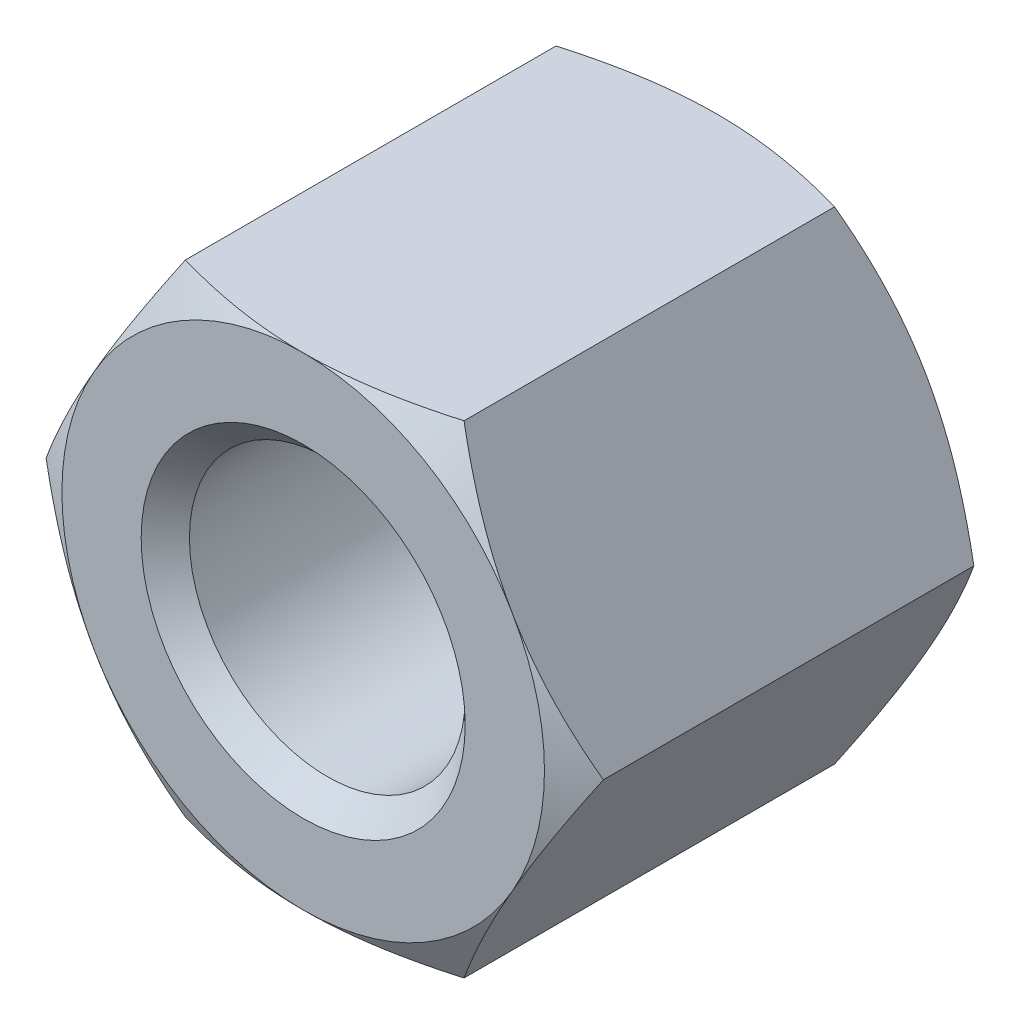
from build123d import *

# Parameters (mm, degrees)
BOSS_EXTRUDE1_DEPTH      = 3
SKETCH2_OUTSIDE_W        = 37.004
SKETCH2_OUTSIDE_H        = 35.922
SKETCH2_OUTSIDE_R        = 3.5
CUT_EXTRUDE1_DEPTH       = 7.130524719
CUT_EXTRUDE1_DRAFT       = -60
SKETCH3_R                = 2
SKETCH3_R_2              = 1.65
CUT_EXTRUDE2_DEPTH       = 3
SKETCH3_2_R              = 1.65
CUT_EXTRUDE3_DEPTH       = 4.05
CHAMFER1_SIZE            = 0.35
MIRROR1_COPY_1_SKETCH_W  = 37.004
MIRROR1_COPY_1_SKETCH_H  = 35.922
MIRROR1_COPY_1_SKETCH_R  = 3.5
MIRROR1_COPY_1_DEPTH     = 7.130524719
MIRROR1_COPY_1_DRAFT     = -60
CHAMFER1_OF_MIRROR1_SIZE = 0.35


with BuildPart() as part:
    # Sketch1 → Boss-Extrude1 (new body)
    with BuildSketch(Plane.XY):
        Polygon((2.020725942, 3.5), (-2.020725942, 3.5), (-4.041451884, 0), (-2.020725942, -3.5), (2.020725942, -3.5), (4.041451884, 0), align=None)
    boss_extrude1 = extrude(amount=-BOSS_EXTRUDE1_DEPTH)


with BuildPart() as cut_extrude1_tool:
    # Sketch2 outside → Cut-Extrude1 (with draft: the straight prism first)
    with BuildSketch(Plane(origin=(0, 0, -3), x_dir=(-1, 0, 0), z_dir=(0, 0, -1))):
        Rectangle(SKETCH2_OUTSIDE_W, SKETCH2_OUTSIDE_H)
        Circle(SKETCH2_OUTSIDE_R, mode=Mode.SUBTRACT)
    extrude(amount=-CUT_EXTRUDE1_DEPTH)
    # Cut-Extrude1: the draft: its side faces are tilted about the plane it starts from
    cut_extrude1_sides = [cut_extrude1_tool.faces().sort_by_distance(p)[0] for p in [
        (0, -17.961, 0.56526236),
        (-18.502, 0, 0.56526236),
        (0, 17.961, 0.56526236),
        (18.502, 0, 0.56526236),
        (3.5, 0, 0.56526236),
    ]]
    draft(cut_extrude1_sides, Plane(origin=(0, 0, -3), x_dir=(-1, 0, 0), z_dir=(0, 0, -1)), CUT_EXTRUDE1_DRAFT)


with BuildPart() as part_1:
    add(part.part)

    # Cut-Extrude1: cut by cut_extrude1_tool
    add(cut_extrude1_tool.part, mode=Mode.SUBTRACT)

    # Sketch3 → Cut-Extrude2 (cut)
    with BuildSketch(Plane(origin=(0, 0, -3), x_dir=(-1, 0, 0), z_dir=(0, 0, -1))):
        Circle(SKETCH3_R)
        Circle(SKETCH3_R_2, mode=Mode.SUBTRACT)
    cut_extrude2 = extrude(amount=-CUT_EXTRUDE2_DEPTH, mode=Mode.SUBTRACT)


with BuildPart() as cut_extrude2_piece_1:
    # of the separate pieces the step leaves, piece 1, a body of its own (cut_extrude2_pieces)
    add(part_1.part.solids().sort_by_distance((2.020725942, 3.5, 0))[0])

    # Chamfer1
    chamfer1_edges = [cut_extrude2_piece_1.edges().sort_by_distance(p)[0] for p in [
        (2, 0, -3),
    ]]
    chamfer(chamfer1_edges, length=CHAMFER1_SIZE)


with BuildPart() as cut_extrude2_piece_2:
    # of the separate pieces the step leaves, piece 2, a body of its own (cut_extrude2_pieces)
    add(part_1.part.solids().sort_by_distance((-1.65, 0, 0))[0])

    # Sketch3_2 → Cut-Extrude3 (cut)
    with BuildSketch(Plane(origin=(0, 0, -3), x_dir=(-1, 0, 0), z_dir=(0, 0, -1))):
        Circle(SKETCH3_2_R)
    cut_extrude3 = extrude(amount=-CUT_EXTRUDE3_DEPTH, mode=Mode.SUBTRACT)


with BuildPart() as cut_extrude2_piece_1_1:
    add(cut_extrude2_piece_1.part)

    # Mirror1: Boss-Extrude1, Cut-Extrude2, Cut-Extrude3 across plane
    add(boss_extrude1.mirror(Plane.XY))
    add(cut_extrude2.mirror(Plane.XY), mode=Mode.SUBTRACT)
    add(cut_extrude3.mirror(Plane.XY), mode=Mode.SUBTRACT)


with BuildPart() as mirror1_copy_1_tool:
    # Mirror1 copy 1 sketch → Mirror1 copy 1 (with draft: the straight prism first)
    with BuildSketch(Plane(origin=(0, 0, 3), x_dir=(-1, 0, 0), z_dir=(0, 0, 1))):
        Rectangle(MIRROR1_COPY_1_SKETCH_W, MIRROR1_COPY_1_SKETCH_H)
        Circle(MIRROR1_COPY_1_SKETCH_R, mode=Mode.SUBTRACT)
    extrude(amount=-MIRROR1_COPY_1_DEPTH)
    # Mirror1 copy 1: the draft: its side faces are tilted about the plane it starts from
    mirror1_copy_1_sides = [mirror1_copy_1_tool.faces().sort_by_distance(p)[0] for p in [
        (0, -17.961, -0.56526236),
        (-18.502, 0, -0.56526236),
        (0, 17.961, -0.56526236),
        (18.502, 0, -0.56526236),
        (3.5, 0, -0.56526236),
    ]]
    draft(mirror1_copy_1_sides, Plane(origin=(0, 0, 3), x_dir=(-1, 0, 0), z_dir=(0, 0, 1)), MIRROR1_COPY_1_DRAFT)


with BuildPart() as cut_extrude2_piece_1_2:
    add(cut_extrude2_piece_1_1.part)

    # Mirror1 copy 1: cut by mirror1_copy_1_tool
    add(mirror1_copy_1_tool.part, mode=Mode.SUBTRACT)

    # Chamfer1 of Mirror1
    chamfer1_of_mirror1_edges = [cut_extrude2_piece_1_2.edges().sort_by_distance(p)[0] for p in [
        (2, 0, 3),
    ]]
    chamfer(chamfer1_of_mirror1_edges, length=CHAMFER1_OF_MIRROR1_SIZE)


solid = cut_extrude2_piece_1_2.part
